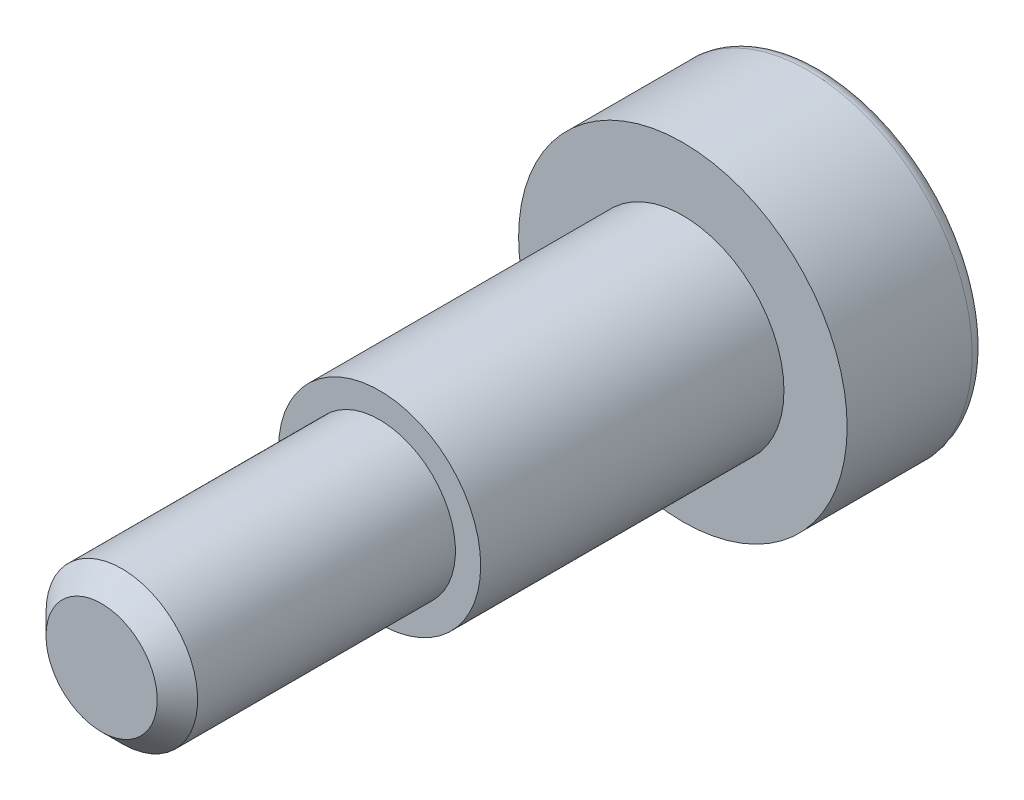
from build123d import *

# Parameters (mm, degrees)
ENLEV_MAT_EXTRU1_DEPTH = 4
ESQUISSE3_W            = 4
ESQUISSE3_H            = 12
ESQUISSE7_R            = 3
EXTRUSION1_DEPTH       = 11
CHANFREIN1_SIZE        = 0.8


with BuildPart() as part:
    # Esquisse1 → Base-R_volution (revolve)
    with BuildSketch(Plane(origin=(0, 0, 0), x_dir=(1, 0, 0), z_dir=(0, 1, 0)), mode=Mode.PRIVATE) as base_r_volution_sk:
        with BuildLine():
            Line((0, 0), (6.5, 0))
            Line((6.5, 0), (6.5, 4.95))
            ThreePointArc((6.5, 4.95), (6.33890873, 5.33890873), (5.95, 5.5))
            Line((5.95, 5.5), (0, 5.5))
            Line((0, 5.5), (0, 0))
        make_face()
    revolve(base_r_volution_sk.sketch.rotate(Axis((0, 0, 0), (0, 0, -1)), 180), axis=Axis((0, 0, 0), (0, 0, -1)))

    # Esquisse2 → enlev-mat-Extru1 (cut)
    with BuildSketch(Plane.XY.offset(-5.5)):
        Polygon((3, -1.732050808), (3, 1.732050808), (0, 3.464101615), (-3, 1.732050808), (-3, -1.732050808), (0, -3.464101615), align=None)
    extrude(amount=ENLEV_MAT_EXTRU1_DEPTH, mode=Mode.SUBTRACT)

    # Esquisse3 → Boss.-R_vol.1 (revolve)
    with BuildSketch(Plane(origin=(0, 0, 0), x_dir=(1, 0, 0), z_dir=(0, 1, 0))):
        with Locations((2, -6)):
            Rectangle(ESQUISSE3_W, ESQUISSE3_H)
    revolve(axis=Axis((0, 0, 0), (0, 0, 1)))

    # Esquisse7 → Extrusion1 (add)
    with BuildSketch(Plane.XY.offset(12)):
        Circle(ESQUISSE7_R)
    extrude(amount=EXTRUSION1_DEPTH)

    # Chanfrein1
    chanfrein1_edges = [part.edges().sort_by_distance(p)[0] for p in [
        (-3, 0, 23),
    ]]
    chamfer(chanfrein1_edges, length=CHANFREIN1_SIZE)


solid = part.part
